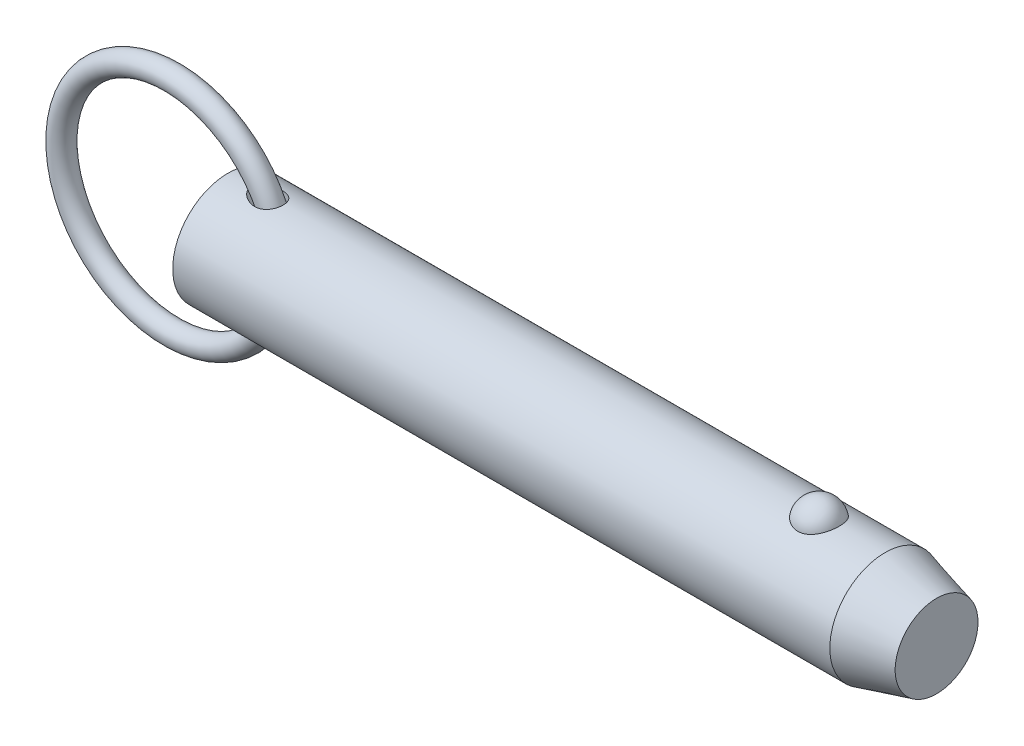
ISO-10303-21;
HEADER;
FILE_DESCRIPTION(('STEP AP214'),'2;1');
FILE_NAME('part.step','',(''),(''),'','','');
FILE_SCHEMA(('AUTOMOTIVE_DESIGN { 1 0 10303 214 1 1 1 1 }'));
ENDSEC;
DATA;
#1=APPLICATION_CONTEXT('core data for automotive mechanical design processes');
#2=APPLICATION_PROTOCOL_DEFINITION('international standard','automotive_design',2000,#1);
#3=PRODUCT_CONTEXT('',#1,'mechanical');
#4=PRODUCT('Part','Part','',(#3));
#5=PRODUCT_RELATED_PRODUCT_CATEGORY('part','',(#4));
#6=PRODUCT_DEFINITION_FORMATION('','',#4);
#7=PRODUCT_DEFINITION_CONTEXT('part definition',#1,'design');
#8=PRODUCT_DEFINITION('design','',#6,#7);
#9=PRODUCT_DEFINITION_SHAPE('','',#8);
#10=(LENGTH_UNIT() NAMED_UNIT(*) SI_UNIT(.MILLI.,.METRE.));
#11=(NAMED_UNIT(*) PLANE_ANGLE_UNIT() SI_UNIT($,.RADIAN.));
#12=(NAMED_UNIT(*) SI_UNIT($,.STERADIAN.) SOLID_ANGLE_UNIT());
#13=UNCERTAINTY_MEASURE_WITH_UNIT(LENGTH_MEASURE(1.E-05),#10,'distance_accuracy_value','');
#14=(GEOMETRIC_REPRESENTATION_CONTEXT(3) GLOBAL_UNCERTAINTY_ASSIGNED_CONTEXT((#13)) GLOBAL_UNIT_ASSIGNED_CONTEXT((#10,
#11,#12)) REPRESENTATION_CONTEXT('',''));
#15=CARTESIAN_POINT('',(0.,0.,0.));
#16=DIRECTION('',(0.,0.,1.));
#17=DIRECTION('',(1.,0.,0.));
#18=AXIS2_PLACEMENT_3D('',#15,#16,#17);
#19=CARTESIAN_POINT('',(-9.66825126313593,0.,0.));
#20=DIRECTION('',(0.,0.,1.));
#21=DIRECTION('',(1.,0.,0.));
#22=AXIS2_PLACEMENT_3D('',#19,#20,#21);
#23=TOROIDAL_SURFACE('',#22,19.05,1.905);
#24=CARTESIAN_POINT('',(11.2867487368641,0.,0.));
#25=VERTEX_POINT('',#24);
#26=VERTEX_LOOP('',#25);
#27=FACE_BOUND('',#26,.T.);
#28=ADVANCED_FACE('P0_F12',(#27),#23,.T.);
#29=CLOSED_SHELL('',(#28));
#30=MANIFOLD_SOLID_BREP('P0_B1',#29);
#31=CARTESIAN_POINT('',(0.,0.,0.));
#32=DIRECTION('',(1.,0.,0.));
#33=DIRECTION('',(0.,0.,-1.));
#34=AXIS2_PLACEMENT_3D('',#31,#32,#33);
#35=CYLINDRICAL_SURFACE('',#34,9.525);
#36=CARTESIAN_POINT('',(4.56693409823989,9.4314194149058,-1.33189820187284));
#37=CARTESIAN_POINT('',(4.70260475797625,9.41020313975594,-1.48215931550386));
#38=CARTESIAN_POINT('',(4.85555680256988,9.38755003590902,-1.61683982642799));
#39=CARTESIAN_POINT('',(5.10171959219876,9.35450554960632,-1.79512943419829));
#40=CARTESIAN_POINT('',(5.18674514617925,9.34362629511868,-1.85068909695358));
#41=CARTESIAN_POINT('',(5.3615438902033,9.32258514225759,-1.95392002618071));
#42=CARTESIAN_POINT('',(5.45131542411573,9.31242299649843,-2.00159402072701));
#43=CARTESIAN_POINT('',(5.70070211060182,9.28632120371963,-2.12033289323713));
#44=CARTESIAN_POINT('',(5.86420408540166,9.27146938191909,-2.18362944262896));
#45=CARTESIAN_POINT('',(6.19893345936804,9.24694163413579,-2.28525783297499));
#46=CARTESIAN_POINT('',(6.3701538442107,9.23726110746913,-2.32361187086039));
#47=CARTESIAN_POINT('',(6.73531776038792,9.22400982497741,-2.37575048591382));
#48=CARTESIAN_POINT('',(6.92975826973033,9.22118808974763,-2.38652934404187));
#49=CARTESIAN_POINT('',(7.21995443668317,9.22416297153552,-2.37494980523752));
#50=CARTESIAN_POINT('',(7.31643847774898,9.22635560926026,-2.366466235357));
#51=CARTESIAN_POINT('',(7.50796421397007,9.2331428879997,-2.33985028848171));
#52=CARTESIAN_POINT('',(7.60300650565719,9.23773650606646,-2.32172202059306));
#53=CARTESIAN_POINT('',(7.83273114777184,9.25183311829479,-2.26504721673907));
#54=CARTESIAN_POINT('',(7.96603028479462,9.26261470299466,-2.2209856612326));
#55=CARTESIAN_POINT('',(8.22310899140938,9.28816519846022,-2.1115730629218));
#56=CARTESIAN_POINT('',(8.34689477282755,9.30293147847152,-2.04623606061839));
#57=CARTESIAN_POINT('',(8.58136049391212,9.3349416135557,-1.89485344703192));
#58=CARTESIAN_POINT('',(8.69199721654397,9.35219324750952,-1.8087422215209));
#59=CARTESIAN_POINT('',(8.89592093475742,9.38707016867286,-1.6179918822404));
#60=CARTESIAN_POINT('',(8.98920771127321,9.40469546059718,-1.51335253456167));
#61=CARTESIAN_POINT('',(9.15057731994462,9.43713590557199,-1.29519427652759));
#62=CARTESIAN_POINT('',(9.21980158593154,9.45205440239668,-1.18253282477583));
#63=CARTESIAN_POINT('',(9.33826736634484,9.47856708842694,-0.946802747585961));
#64=CARTESIAN_POINT('',(9.38751161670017,9.49016173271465,-0.823735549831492));
#65=CARTESIAN_POINT('',(9.46423850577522,9.50859378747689,-0.572614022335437));
#66=CARTESIAN_POINT('',(9.4920239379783,9.5154972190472,-0.444656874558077));
#67=CARTESIAN_POINT('',(9.52636926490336,9.5240690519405,-0.185752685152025));
#68=CARTESIAN_POINT('',(9.53292923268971,9.52573747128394,-0.054805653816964));
#69=CARTESIAN_POINT('',(9.52467276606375,9.52365852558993,0.206503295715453));
#70=CARTESIAN_POINT('',(9.50983454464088,9.51990564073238,0.336864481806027));
#71=CARTESIAN_POINT('',(9.45907362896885,9.50737852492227,0.593166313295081));
#72=CARTESIAN_POINT('',(9.42315106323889,9.49860432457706,0.719106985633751));
#73=CARTESIAN_POINT('',(9.3310664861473,9.4769892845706,0.962959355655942));
#74=CARTESIAN_POINT('',(9.27490839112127,9.46414923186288,1.08087260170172));
#75=CARTESIAN_POINT('',(9.14375803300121,9.43581000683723,1.30534632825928));
#76=CARTESIAN_POINT('',(9.06876720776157,9.42031103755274,1.41190767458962));
#77=CARTESIAN_POINT('',(8.90203187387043,9.38836719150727,1.61069439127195));
#78=CARTESIAN_POINT('',(8.81029913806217,9.371922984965,1.70292975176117));
#79=CARTESIAN_POINT('',(8.6126877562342,9.33985045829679,1.87086859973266));
#80=CARTESIAN_POINT('',(8.50680947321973,9.3242221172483,1.94657251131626));
#81=CARTESIAN_POINT('',(8.28220546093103,9.29513431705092,2.08109032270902));
#82=CARTESIAN_POINT('',(8.16329919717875,9.28171415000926,2.13961034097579));
#83=CARTESIAN_POINT('',(7.91756052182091,9.25859072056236,2.23755716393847));
#84=CARTESIAN_POINT('',(7.79072606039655,9.24888842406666,2.27697900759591));
#85=CARTESIAN_POINT('',(7.52377913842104,9.23338749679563,2.33907806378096));
#86=CARTESIAN_POINT('',(7.3833476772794,9.22789571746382,2.36044900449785));
#87=CARTESIAN_POINT('',(7.1008139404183,9.22210229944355,2.3829751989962));
#88=CARTESIAN_POINT('',(6.95871103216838,9.22180269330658,2.38412253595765));
#89=CARTESIAN_POINT('',(6.65642691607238,9.22632724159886,2.36656230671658));
#90=CARTESIAN_POINT('',(6.49641694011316,9.23185415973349,2.3451317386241));
#91=CARTESIAN_POINT('',(6.18115433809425,9.24811737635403,2.28014143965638));
#92=CARTESIAN_POINT('',(6.02590710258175,9.25885936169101,2.23655754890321));
#93=CARTESIAN_POINT('',(5.69904720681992,9.28624254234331,2.12025087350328));
#94=CARTESIAN_POINT('',(5.52873601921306,9.30354853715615,2.04400672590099));
#95=CARTESIAN_POINT('',(5.20289495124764,9.34106989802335,1.86504730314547));
#96=CARTESIAN_POINT('',(5.0473596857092,9.36128419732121,1.76234172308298));
#97=CARTESIAN_POINT('',(4.7928712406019,9.39697639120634,1.55895334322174));
#98=CARTESIAN_POINT('',(4.68938704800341,9.41240250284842,1.46392900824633));
#99=CARTESIAN_POINT('',(4.4984714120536,9.44202586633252,1.25875918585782));
#100=CARTESIAN_POINT('',(4.41101129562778,9.45622528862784,1.1486413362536));
#101=CARTESIAN_POINT('',(4.27502257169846,9.47888210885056,0.94060098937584));
#102=CARTESIAN_POINT('',(4.22216329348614,9.48791121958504,0.845586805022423));
#103=CARTESIAN_POINT('',(4.13241478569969,9.50344321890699,0.648051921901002));
#104=CARTESIAN_POINT('',(4.0955118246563,9.50994827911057,0.545537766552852));
#105=CARTESIAN_POINT('',(4.04043124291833,9.51971586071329,0.334452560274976));
#106=CARTESIAN_POINT('',(4.02240728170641,9.52295176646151,0.225839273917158));
#107=CARTESIAN_POINT('',(4.00750873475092,9.52562364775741,0.00713006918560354));
#108=CARTESIAN_POINT('',(4.01062334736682,9.52506156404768,-0.102965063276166));
#109=CARTESIAN_POINT('',(4.03592967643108,9.52053221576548,-0.306944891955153));
#110=CARTESIAN_POINT('',(4.05571676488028,9.51699426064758,-0.401151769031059));
#111=CARTESIAN_POINT('',(4.10967975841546,9.5074546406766,-0.585176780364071));
#112=CARTESIAN_POINT('',(4.1438599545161,9.50145224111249,-0.674993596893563));
#113=CARTESIAN_POINT('',(4.23261356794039,9.48611703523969,-0.866116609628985));
#114=CARTESIAN_POINT('',(4.28990016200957,9.47635800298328,-0.966121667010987));
#115=CARTESIAN_POINT('',(4.4185657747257,9.45502867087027,-1.15640011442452));
#116=CARTESIAN_POINT('',(4.4899691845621,9.44345524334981,-1.24665623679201));
#117=CARTESIAN_POINT('',(4.56693409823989,9.4314194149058,-1.33189820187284));
#118=B_SPLINE_CURVE_WITH_KNOTS('',3,(#36,#37,#38,#39,#40,#41,#42,#43,#44,#45,#46,#47,#48,#49,
#50,#51,#52,#53,#54,#55,#56,#57,#58,#59,#60,#61,#62,#63,#64,#65,#66,#67,#68,#69,#70,#71,#72,#73,
#74,#75,#76,#77,#78,#79,#80,#81,#82,#83,#84,#85,#86,#87,#88,#89,#90,#91,#92,#93,#94,#95,#96,#97,
#98,#99,#100,#101,#102,#103,#104,#105,#106,#107,#108,#109,#110,#111,#112,#113,#114,#115,#116,
#117),.UNSPECIFIED.,.T.,.F.,(4,2,2,2,2,2,2,2,2,2,2,2,2,2,2,2,2,2,2,2,2,2,2,2,2,2,2,2,2,2,2,2,2,
2,2,2,2,2,2,2,4),(0.,0.609951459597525,0.916123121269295,1.22218863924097,1.74791337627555,
2.27316961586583,2.85362722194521,3.14383229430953,3.43391382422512,3.85437497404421,
4.27455920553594,4.69608835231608,5.11762282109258,5.51490051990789,5.91212379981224,
6.30363414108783,6.69514313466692,7.0870510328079,7.47895654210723,7.87078624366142,
8.26258603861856,8.65411137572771,9.0456266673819,9.44349251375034,9.84146165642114,
10.2662286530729,10.6911619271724,11.1739180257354,11.6572017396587,12.2170157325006,
12.776624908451,13.1992556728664,13.6211226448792,13.9471990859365,14.2729943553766,
14.6014211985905,14.9296802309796,15.2173810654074,15.505167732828,15.8505863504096,
16.1966070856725),.UNSPECIFIED.);
#119=CARTESIAN_POINT('',(4.56693409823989,9.4314194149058,-1.33189820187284));
#120=VERTEX_POINT('',#119);
#121=EDGE_CURVE('P1_E40',#120,#120,#118,.T.);
#122=ORIENTED_EDGE('',*,*,#121,.T.);
#123=EDGE_LOOP('',(#122));
#124=FACE_BOUND('',#123,.T.);
#125=CARTESIAN_POINT('',(113.343054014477,0.,0.));
#126=DIRECTION('',(1.,0.,0.));
#127=DIRECTION('',(0.,0.,-1.));
#128=AXIS2_PLACEMENT_3D('',#125,#126,#127);
#129=CIRCLE('',#128,9.525);
#130=CARTESIAN_POINT('',(113.343054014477,0.,-9.525));
#131=VERTEX_POINT('',#130);
#132=EDGE_CURVE('P1_E25',#131,#131,#129,.T.);
#133=ORIENTED_EDGE('',*,*,#132,.F.);
#134=EDGE_LOOP('',(#133));
#135=FACE_BOUND('',#134,.T.);
#136=CARTESIAN_POINT('',(0.,0.,0.));
#137=DIRECTION('',(1.,0.,0.));
#138=DIRECTION('',(0.,0.,-1.));
#139=AXIS2_PLACEMENT_3D('',#136,#137,#138);
#140=CIRCLE('',#139,9.525);
#141=CARTESIAN_POINT('',(0.,0.,-9.525));
#142=VERTEX_POINT('',#141);
#143=EDGE_CURVE('P1_E9',#142,#142,#140,.T.);
#144=ORIENTED_EDGE('',*,*,#143,.T.);
#145=EDGE_LOOP('',(#144));
#146=FACE_BOUND('',#145,.T.);
#147=CARTESIAN_POINT('',(101.945757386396,8.80405803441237,3.63513233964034));
#148=CARTESIAN_POINT('',(101.851676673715,8.80405953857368,3.63513053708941));
#149=CARTESIAN_POINT('',(101.757561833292,8.80561325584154,3.63137461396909));
#150=CARTESIAN_POINT('',(101.570012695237,8.81177748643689,3.61638665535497));
#151=CARTESIAN_POINT('',(101.476578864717,8.81638992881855,3.60514990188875));
#152=CARTESIAN_POINT('',(101.197945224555,8.83467114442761,3.56024627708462));
#153=CARTESIAN_POINT('',(101.014691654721,8.85278327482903,3.5153862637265));
#154=CARTESIAN_POINT('',(100.659509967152,8.89871214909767,3.39742145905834));
#155=CARTESIAN_POINT('',(100.487553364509,8.92650327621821,3.32439116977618));
#156=CARTESIAN_POINT('',(100.158707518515,8.98874819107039,3.15220244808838));
#157=CARTESIAN_POINT('',(100.001811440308,9.02319893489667,3.05305594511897));
#158=CARTESIAN_POINT('',(99.7022147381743,9.09629186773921,2.82797815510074));
#159=CARTESIAN_POINT('',(99.5600600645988,9.13502685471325,2.70135138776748));
#160=CARTESIAN_POINT('',(99.2982999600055,9.2118657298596,2.42641932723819));
#161=CARTESIAN_POINT('',(99.1787015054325,9.2499694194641,2.27810735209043));
#162=CARTESIAN_POINT('',(98.959645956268,9.32341082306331,1.95652290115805));
#163=CARTESIAN_POINT('',(98.8613174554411,9.35855090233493,1.78243511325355));
#164=CARTESIAN_POINT('',(98.6938190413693,9.42045142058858,1.419372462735));
#165=CARTESIAN_POINT('',(98.6246511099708,9.44721128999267,1.23039658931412));
#166=CARTESIAN_POINT('',(98.5161994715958,9.48990641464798,0.840370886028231));
#167=CARTESIAN_POINT('',(98.4772880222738,9.50570658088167,0.639202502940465));
#168=CARTESIAN_POINT('',(98.4315550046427,9.52433146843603,0.232664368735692));
#169=CARTESIAN_POINT('',(98.4247324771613,9.52715657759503,0.0272947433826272));
#170=CARTESIAN_POINT('',(98.443255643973,9.51956918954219,-0.380478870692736));
#171=CARTESIAN_POINT('',(98.4684052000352,9.50923740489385,-0.582893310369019));
#172=CARTESIAN_POINT('',(98.55002537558,9.47651897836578,-0.980293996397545));
#173=CARTESIAN_POINT('',(98.6064966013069,9.45413210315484,-1.17528009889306));
#174=CARTESIAN_POINT('',(98.7497192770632,9.39954044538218,-1.55263697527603));
#175=CARTESIAN_POINT('',(98.8365124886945,9.36732213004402,-1.73498993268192));
#176=CARTESIAN_POINT('',(99.0386103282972,9.29640700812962,-2.08177763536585));
#177=CARTESIAN_POINT('',(99.1539172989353,9.25770966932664,-2.24621090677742));
#178=CARTESIAN_POINT('',(99.411264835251,9.17775604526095,-2.55338333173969));
#179=CARTESIAN_POINT('',(99.5534344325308,9.136488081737,-2.696011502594));
#180=CARTESIAN_POINT('',(99.8608998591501,9.05620497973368,-2.95451229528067));
#181=CARTESIAN_POINT('',(100.026193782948,9.01718965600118,-3.070387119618));
#182=CARTESIAN_POINT('',(100.372052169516,8.94680019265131,-3.26976836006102));
#183=CARTESIAN_POINT('',(100.552227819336,8.91528408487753,-3.353897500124));
#184=CARTESIAN_POINT('',(100.925651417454,8.86272514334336,-3.49043503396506));
#185=CARTESIAN_POINT('',(101.118894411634,8.84167836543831,-3.54285537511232));
#186=CARTESIAN_POINT('',(101.502503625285,8.81348056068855,-3.61241306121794));
#187=CARTESIAN_POINT('',(101.692525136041,8.80568348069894,-3.6311933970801));
#188=CARTESIAN_POINT('',(102.073190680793,8.80289410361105,-3.63795342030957));
#189=CARTESIAN_POINT('',(102.263834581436,8.80789922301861,-3.62593932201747));
#190=CARTESIAN_POINT('',(102.634007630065,8.82974915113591,-3.57238430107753));
#191=CARTESIAN_POINT('',(102.813697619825,8.84621463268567,-3.53178890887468));
#192=CARTESIAN_POINT('',(103.163422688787,8.88875330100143,-3.42331083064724));
#193=CARTESIAN_POINT('',(103.333456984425,8.91482726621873,-3.35542593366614));
#194=CARTESIAN_POINT('',(103.663237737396,8.97448239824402,-3.19248225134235));
#195=CARTESIAN_POINT('',(103.822680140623,9.00821446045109,-3.0968647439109));
#196=CARTESIAN_POINT('',(104.123513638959,9.07935398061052,-2.88162736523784));
#197=CARTESIAN_POINT('',(104.264900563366,9.11676228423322,-2.76200196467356));
#198=CARTESIAN_POINT('',(104.53331931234,9.19347419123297,-2.49516285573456));
#199=CARTESIAN_POINT('',(104.659275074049,9.23277872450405,-2.34686614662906));
#200=CARTESIAN_POINT('',(104.885522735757,9.30737610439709,-2.03093683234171));
#201=CARTESIAN_POINT('',(104.98581004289,9.34266823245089,-1.86330077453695));
#202=CARTESIAN_POINT('',(105.161514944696,9.40674710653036,-1.50744893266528));
#203=CARTESIAN_POINT('',(105.236041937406,9.43529176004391,-1.31874876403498));
#204=CARTESIAN_POINT('',(105.35416505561,9.48144132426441,-0.930631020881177));
#205=CARTESIAN_POINT('',(105.397760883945,9.49904612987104,-0.731213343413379));
#206=CARTESIAN_POINT('',(105.453158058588,9.5215314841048,-0.327147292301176));
#207=CARTESIAN_POINT('',(105.464935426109,9.52640243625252,-0.122495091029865));
#208=CARTESIAN_POINT('',(105.456382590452,9.5228957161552,0.286018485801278));
#209=CARTESIAN_POINT('',(105.43605305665,9.5145183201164,0.489879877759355));
#210=CARTESIAN_POINT('',(105.363884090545,9.48544083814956,0.889994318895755));
#211=CARTESIAN_POINT('',(105.312199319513,9.46480124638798,1.08627971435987));
#212=CARTESIAN_POINT('',(105.178491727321,9.4133389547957,1.46682086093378));
#213=CARTESIAN_POINT('',(105.096466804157,9.38251554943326,1.65107577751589));
#214=CARTESIAN_POINT('',(104.90319292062,9.31365636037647,2.00346348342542));
#215=CARTESIAN_POINT('',(104.791783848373,9.27558138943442,2.17150083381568));
#216=CARTESIAN_POINT('',(104.542294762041,9.19638714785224,2.48563115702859));
#217=CARTESIAN_POINT('',(104.404216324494,9.15526805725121,2.63172542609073));
#218=CARTESIAN_POINT('',(104.104843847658,9.07465393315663,2.89750997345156));
#219=CARTESIAN_POINT('',(103.943610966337,9.03515496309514,3.01726776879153));
#220=CARTESIAN_POINT('',(103.601613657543,8.96227564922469,3.22732920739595));
#221=CARTESIAN_POINT('',(103.420841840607,8.92889763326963,3.31762165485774));
#222=CARTESIAN_POINT('',(103.051445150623,8.8734538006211,3.46314419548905));
#223=CARTESIAN_POINT('',(102.86332371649,8.85102983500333,3.51950082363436));
#224=CARTESIAN_POINT('',(102.57578699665,8.8266696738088,3.57993683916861));
#225=CARTESIAN_POINT('',(102.479133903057,8.82009725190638,3.5960621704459));
#226=CARTESIAN_POINT('',(102.284677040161,8.81020897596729,3.62022512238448));
#227=CARTESIAN_POINT('',(102.18687410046,8.80689090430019,3.62826825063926));
#228=CARTESIAN_POINT('',(102.041224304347,8.80445615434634,3.63416760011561));
#229=CARTESIAN_POINT('',(101.993495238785,8.80405727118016,3.63513325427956));
#230=CARTESIAN_POINT('',(101.945757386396,8.80405803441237,3.63513233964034));
#231=B_SPLINE_CURVE_WITH_KNOTS('',3,(#147,#148,#149,#150,#151,#152,#153,#154,#155,#156,#157,
#158,#159,#160,#161,#162,#163,#164,#165,#166,#167,#168,#169,#170,#171,#172,#173,#174,#175,#176,
#177,#178,#179,#180,#181,#182,#183,#184,#185,#186,#187,#188,#189,#190,#191,#192,#193,#194,#195,
#196,#197,#198,#199,#200,#201,#202,#203,#204,#205,#206,#207,#208,#209,#210,#211,#212,#213,#214,
#215,#216,#217,#218,#219,#220,#221,#222,#223,#224,#225,#226,#227,#228,#229,#230),.UNSPECIFIED.,
.T.,.F.,(4,2,2,2,2,2,2,2,2,2,2,2,2,2,2,2,2,2,2,2,2,2,2,2,2,2,2,2,2,2,2,2,2,2,2,2,2,2,2,2,2,4),
(0.,0.282202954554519,0.564584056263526,1.13017050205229,1.69427128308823,2.25811483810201,
2.83836627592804,3.4187968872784,4.02497117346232,4.63118665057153,5.24474754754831,
5.85829010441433,6.46808687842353,7.07789545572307,7.68854723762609,8.29924920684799,
8.9129628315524,9.52662591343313,10.1275338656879,10.7282152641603,11.2986646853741,
11.8689989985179,12.4213015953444,12.973648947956,13.5380053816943,14.1024919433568,
14.6952986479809,15.2882113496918,15.8999469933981,16.5116885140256,17.1238909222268,
17.7360805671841,18.3452748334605,18.9545113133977,19.567138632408,20.179729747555,
20.7907316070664,21.4019653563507,21.9915938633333,22.2859053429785,22.5800161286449,
22.7232098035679),.UNSPECIFIED.);
#232=CARTESIAN_POINT('',(101.945757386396,8.80405803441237,3.63513233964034));
#233=VERTEX_POINT('',#232);
#234=EDGE_CURVE('P1_E34',#233,#233,#231,.T.);
#235=ORIENTED_EDGE('',*,*,#234,.T.);
#236=EDGE_LOOP('',(#235));
#237=FACE_BOUND('',#236,.T.);
#238=CARTESIAN_POINT('',(4.56693409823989,-9.4314194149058,-1.33189820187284));
#239=CARTESIAN_POINT('',(4.48932984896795,-9.4435553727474,-1.24594548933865));
#240=CARTESIAN_POINT('',(4.41737309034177,-9.45522193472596,-1.1548795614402));
#241=CARTESIAN_POINT('',(4.2878104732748,-9.47670896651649,-0.962782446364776));
#242=CARTESIAN_POINT('',(4.23019403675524,-9.48653079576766,-0.861758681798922));
#243=CARTESIAN_POINT('',(4.132545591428,-9.5034118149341,-0.649723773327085));
#244=CARTESIAN_POINT('',(4.09271158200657,-9.51043980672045,-0.538615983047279));
#245=CARTESIAN_POINT('',(4.04973167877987,-9.51806966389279,-0.367764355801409));
#246=CARTESIAN_POINT('',(4.03820037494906,-9.52012756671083,-0.310118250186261));
#247=CARTESIAN_POINT('',(4.02100287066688,-9.52320274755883,-0.193935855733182));
#248=CARTESIAN_POINT('',(4.01533565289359,-9.52422020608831,-0.135399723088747));
#249=CARTESIAN_POINT('',(4.0081707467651,-9.52550497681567,0.0247266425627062));
#250=CARTESIAN_POINT('',(4.01270492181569,-9.52468821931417,0.126661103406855));
#251=CARTESIAN_POINT('',(4.03954973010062,-9.51988506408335,0.328012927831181));
#252=CARTESIAN_POINT('',(4.06186450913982,-9.51589792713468,0.427429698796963));
#253=CARTESIAN_POINT('',(4.12088980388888,-9.50548528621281,0.616362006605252));
#254=CARTESIAN_POINT('',(4.15684838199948,-9.49918763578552,0.706123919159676));
#255=CARTESIAN_POINT('',(4.24094647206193,-9.48470618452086,0.879522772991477));
#256=CARTESIAN_POINT('',(4.28909090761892,-9.47652162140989,0.963157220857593));
#257=CARTESIAN_POINT('',(4.42295891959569,-9.45426317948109,1.16513741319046));
#258=CARTESIAN_POINT('',(4.51523752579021,-9.43933320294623,1.27905352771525));
#259=CARTESIAN_POINT('',(4.71682295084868,-9.40825940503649,1.49055892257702));
#260=CARTESIAN_POINT('',(4.82617286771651,-9.39211256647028,1.58810554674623));
#261=CARTESIAN_POINT('',(5.09064226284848,-9.35555264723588,1.79246125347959));
#262=CARTESIAN_POINT('',(5.2499041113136,-9.33524115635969,1.89393122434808));
#263=CARTESIAN_POINT('',(5.58309255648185,-9.29785396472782,2.06968659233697));
#264=CARTESIAN_POINT('',(5.75702897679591,-9.28078045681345,2.14395359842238));
#265=CARTESIAN_POINT('',(6.11646882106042,-9.25213303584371,2.26440412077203));
#266=CARTESIAN_POINT('',(6.30205582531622,-9.2406056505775,2.31035092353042));
#267=CARTESIAN_POINT('',(6.67856093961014,-9.22541807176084,2.37029728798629));
#268=CARTESIAN_POINT('',(6.8694704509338,-9.2217458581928,2.3843456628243));
#269=CARTESIAN_POINT('',(7.21217144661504,-9.2234423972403,2.37775005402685));
#270=CARTESIAN_POINT('',(7.36409439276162,-9.22713860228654,2.36352577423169));
#271=CARTESIAN_POINT('',(7.66346227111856,-9.24048072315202,2.31082299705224));
#272=CARTESIAN_POINT('',(7.81090958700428,-9.25012341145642,2.27235765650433));
#273=CARTESIAN_POINT('',(8.09730316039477,-9.2746609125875,2.17003648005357));
#274=CARTESIAN_POINT('',(8.23619652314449,-9.28958517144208,2.10603803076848));
#275=CARTESIAN_POINT('',(8.49918675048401,-9.32290326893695,1.95324442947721));
#276=CARTESIAN_POINT('',(8.62328895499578,-9.34129584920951,1.86445826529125));
#277=CARTESIAN_POINT('',(8.84006515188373,-9.37706953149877,1.67466761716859));
#278=CARTESIAN_POINT('',(8.93465172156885,-9.39436331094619,1.57582357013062));
#279=CARTESIAN_POINT('',(9.1049023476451,-9.42761680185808,1.362809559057));
#280=CARTESIAN_POINT('',(9.18057146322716,-9.44357686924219,1.24864370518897));
#281=CARTESIAN_POINT('',(9.30789178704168,-9.47159985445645,1.01379272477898));
#282=CARTESIAN_POINT('',(9.36045544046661,-9.48380365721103,0.893617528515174));
#283=CARTESIAN_POINT('',(9.44498362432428,-9.50388751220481,0.645890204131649));
#284=CARTESIAN_POINT('',(9.47694947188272,-9.51176784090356,0.518338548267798));
#285=CARTESIAN_POINT('',(9.51944262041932,-9.52232073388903,0.260103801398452));
#286=CARTESIAN_POINT('',(9.53006646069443,-9.52501674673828,0.129437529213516));
#287=CARTESIAN_POINT('',(9.52993291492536,-9.52498309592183,-0.131885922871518));
#288=CARTESIAN_POINT('',(9.5191752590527,-9.52225336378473,-0.262543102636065));
#289=CARTESIAN_POINT('',(9.47648788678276,-9.51165418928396,-0.520312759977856));
#290=CARTESIAN_POINT('',(9.44453086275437,-9.50377811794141,-0.647420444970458));
#291=CARTESIAN_POINT('',(9.36015568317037,-9.48373425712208,-0.894290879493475));
#292=CARTESIAN_POINT('',(9.30773827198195,-9.47156662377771,-1.01405389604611));
#293=CARTESIAN_POINT('',(9.1838089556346,-9.44428888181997,-1.24269386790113));
#294=CARTESIAN_POINT('',(9.11232064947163,-9.42918241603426,-1.35158405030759));
#295=CARTESIAN_POINT('',(8.9521268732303,-9.39767706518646,-1.55562459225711));
#296=CARTESIAN_POINT('',(8.86342281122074,-9.3812782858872,-1.65077607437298));
#297=CARTESIAN_POINT('',(8.67104443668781,-9.34891827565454,-1.8251751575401));
#298=CARTESIAN_POINT('',(8.56732858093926,-9.33295841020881,-1.90437711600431));
#299=CARTESIAN_POINT('',(8.34818438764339,-9.30317889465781,-2.0449122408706));
#300=CARTESIAN_POINT('',(8.23275529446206,-9.28935938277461,-2.10624425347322));
#301=CARTESIAN_POINT('',(7.98961240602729,-9.26475003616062,-2.2120340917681));
#302=CARTESIAN_POINT('',(7.86162088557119,-9.25407358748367,-2.25587700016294));
#303=CARTESIAN_POINT('',(7.60027499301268,-9.23720810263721,-2.32397032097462));
#304=CARTESIAN_POINT('',(7.46691858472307,-9.23102078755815,-2.34821321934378));
#305=CARTESIAN_POINT('',(7.18516230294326,-9.22302718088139,-2.37943079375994));
#306=CARTESIAN_POINT('',(7.03654454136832,-9.22169704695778,-2.38452997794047));
#307=CARTESIAN_POINT('',(6.7401504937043,-9.22442327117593,-2.37395141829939));
#308=CARTESIAN_POINT('',(6.59237455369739,-9.22848170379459,-2.35826567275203));
#309=CARTESIAN_POINT('',(6.27762777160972,-9.2422287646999,-2.30385559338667));
#310=CARTESIAN_POINT('',(6.11124715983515,-9.25269504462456,-2.26192683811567));
#311=CARTESIAN_POINT('',(5.78635920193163,-9.27830776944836,-2.15445569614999));
#312=CARTESIAN_POINT('',(5.62786567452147,-9.29346211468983,-2.08887341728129));
#313=CARTESIAN_POINT('',(5.39013065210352,-9.31931237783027,-1.96924953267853));
#314=CARTESIAN_POINT('',(5.30683088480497,-9.32901725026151,-1.92292485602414));
#315=CARTESIAN_POINT('',(5.1445580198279,-9.34899035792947,-1.82334419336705));
#316=CARTESIAN_POINT('',(5.06558607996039,-9.35925874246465,-1.77008636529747));
#317=CARTESIAN_POINT('',(4.83670950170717,-9.39034445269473,-1.60010986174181));
#318=CARTESIAN_POINT('',(4.69422471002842,-9.41151337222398,-1.47288240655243));
#319=CARTESIAN_POINT('',(4.56693409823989,-9.4314194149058,-1.33189820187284));
#320=B_SPLINE_CURVE_WITH_KNOTS('',3,(#238,#239,#240,#241,#242,#243,#244,#245,#246,#247,#248,
#249,#250,#251,#252,#253,#254,#255,#256,#257,#258,#259,#260,#261,#262,#263,#264,#265,#266,#267,
#268,#269,#270,#271,#272,#273,#274,#275,#276,#277,#278,#279,#280,#281,#282,#283,#284,#285,#286,
#287,#288,#289,#290,#291,#292,#293,#294,#295,#296,#297,#298,#299,#300,#301,#302,#303,#304,#305,
#306,#307,#308,#309,#310,#311,#312,#313,#314,#315,#316,#317,#318,#319),.UNSPECIFIED.,.T.,.F.,(4,
2,2,2,2,2,2,2,2,2,2,2,2,2,2,2,2,2,2,2,2,2,2,2,2,2,2,2,2,2,2,2,2,2,2,2,2,2,2,2,4),(0.,
0.348900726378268,0.697543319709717,1.0499765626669,1.22617690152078,1.40234666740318,
1.70666745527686,2.01105922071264,2.30066493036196,2.59038784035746,3.03001384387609,
3.4707682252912,4.03766594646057,4.60494622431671,5.17690598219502,5.74798989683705,
6.20400848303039,6.65977977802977,7.11813321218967,7.57632066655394,7.98791759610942,
8.39940433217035,8.79273459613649,9.18603970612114,9.57756168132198,9.96908859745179,
10.3611208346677,10.7531388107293,11.1446739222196,11.536177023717,11.9287850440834,
12.3214184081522,12.7268448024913,13.1324265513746,13.5768390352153,14.0214226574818,
14.5351685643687,15.0497849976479,15.3368801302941,15.6240516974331,16.1963372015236),.UNSPECIFIED.);
#321=CARTESIAN_POINT('',(4.56693409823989,-9.4314194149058,-1.33189820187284));
#322=VERTEX_POINT('',#321);
#323=EDGE_CURVE('P1_E17',#322,#322,#320,.T.);
#324=ORIENTED_EDGE('',*,*,#323,.T.);
#325=EDGE_LOOP('',(#324));
#326=FACE_BOUND('',#325,.T.);
#327=ADVANCED_FACE('P1_F13',(#124,#135,#146,#237,#326),#35,.T.);
#328=CARTESIAN_POINT('',(0.,0.,0.));
#329=DIRECTION('',(-1.,0.,0.));
#330=DIRECTION('',(0.,0.,1.));
#331=AXIS2_PLACEMENT_3D('',#328,#329,#330);
#332=PLANE('',#331);
#333=ORIENTED_EDGE('',*,*,#143,.F.);
#334=EDGE_LOOP('',(#333));
#335=FACE_BOUND('',#334,.T.);
#336=ADVANCED_FACE('P1_F15',(#335),#332,.T.);
#337=CARTESIAN_POINT('',(122.23,0.,0.));
#338=DIRECTION('',(-1.,0.,0.));
#339=DIRECTION('',(0.,0.,1.));
#340=AXIS2_PLACEMENT_3D('',#337,#338,#339);
#341=CONICAL_SURFACE('',#340,7.14375000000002,0.26179938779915);
#342=ORIENTED_EDGE('',*,*,#132,.T.);
#343=EDGE_LOOP('',(#342));
#344=FACE_BOUND('',#343,.T.);
#345=CARTESIAN_POINT('',(122.23,0.,0.));
#346=DIRECTION('',(1.,0.,0.));
#347=DIRECTION('',(0.,0.,-1.));
#348=AXIS2_PLACEMENT_3D('',#345,#346,#347);
#349=CIRCLE('',#348,7.14375000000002);
#350=CARTESIAN_POINT('',(122.23,0.,-7.14375000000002));
#351=VERTEX_POINT('',#350);
#352=EDGE_CURVE('P1_E30',#351,#351,#349,.T.);
#353=ORIENTED_EDGE('',*,*,#352,.F.);
#354=EDGE_LOOP('',(#353));
#355=FACE_BOUND('',#354,.T.);
#356=ADVANCED_FACE('P1_F55',(#344,#355),#341,.T.);
#357=CARTESIAN_POINT('',(122.23,7.14375000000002,0.));
#358=DIRECTION('',(1.,0.,0.));
#359=DIRECTION('',(0.,0.,-1.));
#360=AXIS2_PLACEMENT_3D('',#357,#358,#359);
#361=PLANE('',#360);
#362=ORIENTED_EDGE('',*,*,#352,.T.);
#363=EDGE_LOOP('',(#362));
#364=FACE_BOUND('',#363,.T.);
#365=ADVANCED_FACE('P1_F51',(#364),#361,.T.);
#366=CARTESIAN_POINT('',(101.945757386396,8.5725,0.));
#367=DIRECTION('',(-1.,0.,0.));
#368=DIRECTION('',(0.,1.,0.));
#369=AXIS2_PLACEMENT_3D('',#366,#367,#368);
#370=SPHERICAL_SURFACE('',#369,3.64249999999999);
#371=ORIENTED_EDGE('',*,*,#234,.F.);
#372=EDGE_LOOP('',(#371));
#373=FACE_BOUND('',#372,.T.);
#374=ADVANCED_FACE('P1_F46',(#373),#370,.T.);
#375=CARTESIAN_POINT('',(-9.66825126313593,0.,0.));
#376=DIRECTION('',(0.,0.,1.));
#377=DIRECTION('',(1.,0.,0.));
#378=AXIS2_PLACEMENT_3D('',#375,#376,#377);
#379=TOROIDAL_SURFACE('',#378,19.05,2.38125);
#380=ORIENTED_EDGE('',*,*,#323,.F.);
#381=EDGE_LOOP('',(#380));
#382=FACE_BOUND('',#381,.T.);
#383=ORIENTED_EDGE('',*,*,#121,.F.);
#384=EDGE_LOOP('',(#383));
#385=FACE_BOUND('',#384,.T.);
#386=ADVANCED_FACE('P1_F50',(#382,#385),#379,.F.);
#387=CLOSED_SHELL('',(#327,#336,#356,#365,#374,#386));
#388=MANIFOLD_SOLID_BREP('P1_B1',#387);
#389=ADVANCED_BREP_SHAPE_REPRESENTATION('',(#18,#30,#388),#14);
#390=SHAPE_DEFINITION_REPRESENTATION(#9,#389);
ENDSEC;
END-ISO-10303-21;
